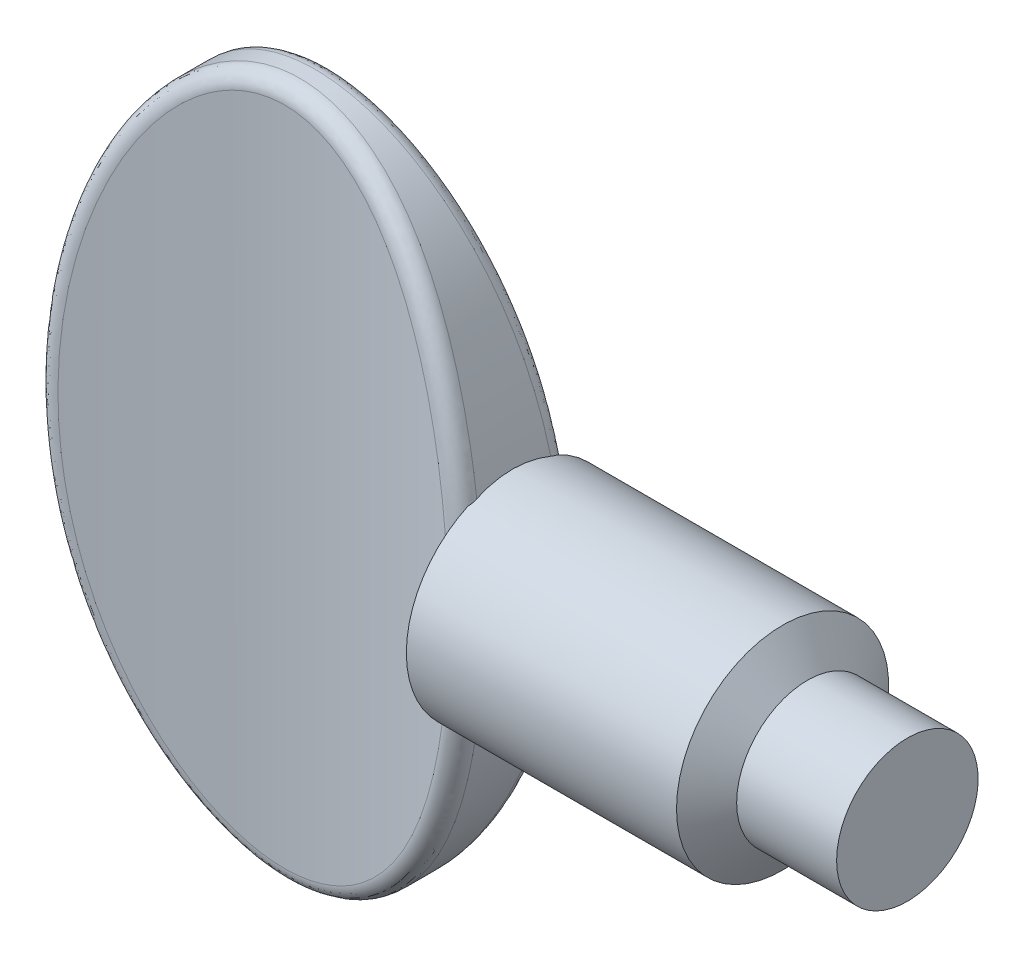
from build123d import *

# Parameters (mm, degrees)
SKETCH1_RX              = 5.715
SKETCH1_RY              = 3.556
EXTRUDE1_DEPTH          = 1.016
CUT_EXTRUDE1_DEPTH      = 7.8072473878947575
CUT_EXTRUDE1_DEPTH_BACK = 7.8072473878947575
SKETCH2_OUTSIDE_W       = 11.834000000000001
SKETCH2_OUTSIDE_H       = 6.754
FILLET3_R               = 0.254


with BuildPart() as part:
    # Sketch1 → Extrude1 (new, symmetric)
    with BuildSketch(Plane.XY):
        with Locations(Location((0, 0), (0, 0, -90))):
            Ellipse(SKETCH1_RX, SKETCH1_RY)
    extrude(amount=EXTRUDE1_DEPTH, both=True)

    # Sketch2 outside → Cut-Extrude1 (cut, two sides: drawn at the far end of the back side and taken through both)
    with BuildSketch(Plane(origin=(0, 0, 0), x_dir=(1, 0, 0), z_dir=(0, 1, 0)).offset(-CUT_EXTRUDE1_DEPTH_BACK)):
        Rectangle(SKETCH2_OUTSIDE_W, SKETCH2_OUTSIDE_H)
        with BuildLine():
            Line((-3.556, 1.016), (-3.556, -1.016))
            ThreePointArc((-3.556, -1.016), (6.3e-16, -0.3810000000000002), (3.556, -1.016))
            Line((3.556, -1.016), (3.556, 1.016))
            ThreePointArc((3.556, 1.016), (6.3e-16, 0.3810000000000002), (-3.556, 1.016))
        make_face(mode=Mode.SUBTRACT)
    extrude(amount=CUT_EXTRUDE1_DEPTH + CUT_EXTRUDE1_DEPTH_BACK, mode=Mode.SUBTRACT)

    # Fillet3
    fillet3_edges = [part.edges().sort_by_distance(p)[0] for p in [
        (-2.772297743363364, -3.579097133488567, 0.7620899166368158),
        (6.761380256e-08, 5.714999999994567, -0.38099999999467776),
    ]]
    fillet(fillet3_edges, radius=FILLET3_R)

    # Sketch3 → Revolve1 (revolve)
    with BuildSketch(Plane(origin=(0, 0, 0), x_dir=(1, 0, 0), z_dir=(0, 1, 0)), mode=Mode.PRIVATE) as revolve1_sk:
        with BuildLine():
            Line((9.906, 0), (9.906, 1.1684))
            Line((9.906, 1.1684), (8.255, 1.1683999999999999))
            Line((8.255, 1.1683999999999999), (7.845938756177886, 1.7526))
            Line((7.845938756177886, 1.7526), (4.741333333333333, 1.7526))
            Line((4.741333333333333, 1.7526), (3.3846611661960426, 1.7526000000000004))
            ThreePointArc((3.3846611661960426, 1.7526000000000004), (3.1592934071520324, 1.093146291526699), (2.577464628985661, 0.7095513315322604))
            Line((2.577464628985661, 0.7095513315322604), (2.577464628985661, 1e-17))
            Line((2.577464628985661, 1e-17), (9.906, 0))
        make_face()
    revolve(revolve1_sk.sketch.rotate(Axis((0, 0, 0), (1, 0, 0)), 180), axis=Axis((0, 0, 0), (1, 0, 0)))


solid = part.part
